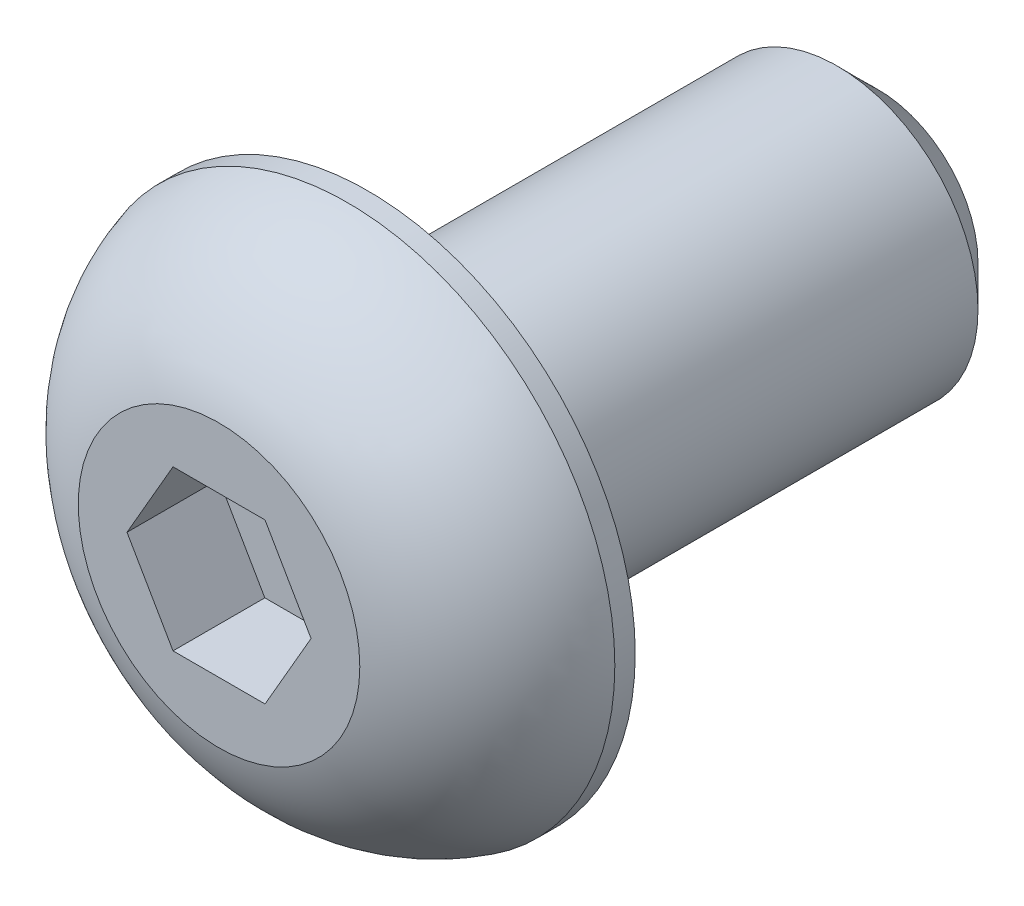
from build123d import *

# Parameters (mm, degrees)
CUT_EXTRUDE1_DEPTH = 1.143


with BuildPart() as part:
    # Sketch1 → Revolve1 (revolve)
    with BuildSketch(Plane(origin=(0, 0, 0), x_dir=(0, 0, -1), z_dir=(1, 0, 0)), mode=Mode.PRIVATE) as revolve1_sk:
        with BuildLine():
            Line((0, 1.7526), (0, 3.3274))
            Line((0, 3.3274), (-0.254, 3.3274))
            ThreePointArc((-0.254, 3.3274), (-1.260747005, 2.749980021), (-1.8542, 1.7526))
            Line((-1.8542, 1.7526), (-1.8542, 0))
            Line((-1.8542, 0), (6.35, 0))
            Line((6.35, 0), (6.35, 1.2446))
            Line((6.35, 1.2446), (5.842, 1.7526))
            Line((5.842, 1.7526), (0, 1.7526))
        make_face()
    revolve(revolve1_sk.sketch.rotate(Axis((0, 0, 3.15095222), (0, 0, -1)), 90), axis=Axis((0, 0, 3.15095222), (0, 0, -1)))

    # Sketch2 → Cut-Extrude1 (cut)
    with BuildSketch(Plane.XY.offset(1.8542)):
        Polygon((-0.57283972, -0.9921875), (0.57283972, -0.9921875), (1.14567944, 0), (0.57283972, 0.9921875), (-0.57283972, 0.9921875), (-1.14567944, 0), align=None)
    extrude(amount=-CUT_EXTRUDE1_DEPTH, mode=Mode.SUBTRACT)


solid = part.part
